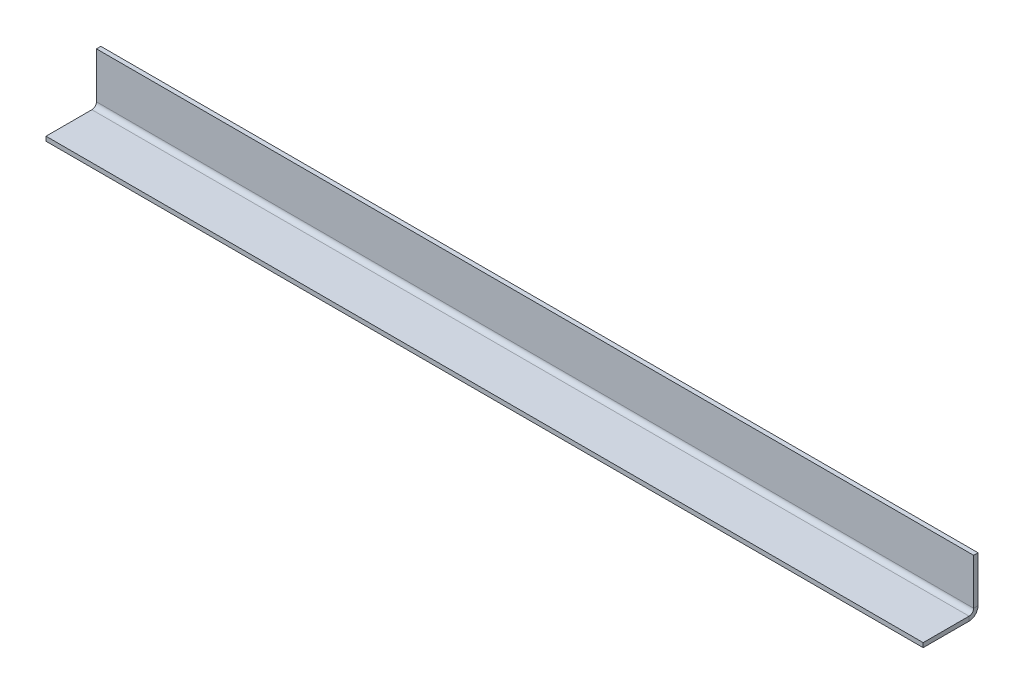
ISO-10303-21;
HEADER;
FILE_DESCRIPTION(('STEP AP214'),'2;1');
FILE_NAME('part.step','',(''),(''),'','','');
FILE_SCHEMA(('AUTOMOTIVE_DESIGN { 1 0 10303 214 1 1 1 1 }'));
ENDSEC;
DATA;
#1=APPLICATION_CONTEXT('core data for automotive mechanical design processes');
#2=APPLICATION_PROTOCOL_DEFINITION('international standard','automotive_design',2000,#1);
#3=PRODUCT_CONTEXT('',#1,'mechanical');
#4=PRODUCT('Part','Part','',(#3));
#5=PRODUCT_RELATED_PRODUCT_CATEGORY('part','',(#4));
#6=PRODUCT_DEFINITION_FORMATION('','',#4);
#7=PRODUCT_DEFINITION_CONTEXT('part definition',#1,'design');
#8=PRODUCT_DEFINITION('design','',#6,#7);
#9=PRODUCT_DEFINITION_SHAPE('','',#8);
#10=(LENGTH_UNIT() NAMED_UNIT(*) SI_UNIT(.MILLI.,.METRE.));
#11=(NAMED_UNIT(*) PLANE_ANGLE_UNIT() SI_UNIT($,.RADIAN.));
#12=(NAMED_UNIT(*) SI_UNIT($,.STERADIAN.) SOLID_ANGLE_UNIT());
#13=UNCERTAINTY_MEASURE_WITH_UNIT(LENGTH_MEASURE(1.E-05),#10,'distance_accuracy_value','');
#14=(GEOMETRIC_REPRESENTATION_CONTEXT(3) GLOBAL_UNCERTAINTY_ASSIGNED_CONTEXT((#13)) GLOBAL_UNIT_ASSIGNED_CONTEXT((#10,
#11,#12)) REPRESENTATION_CONTEXT('',''));
#15=CARTESIAN_POINT('',(0.,0.,0.));
#16=DIRECTION('',(0.,0.,1.));
#17=DIRECTION('',(1.,0.,0.));
#18=AXIS2_PLACEMENT_3D('',#15,#16,#17);
#19=CARTESIAN_POINT('',(0.,6.22299999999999,0.));
#20=DIRECTION('',(-1.,0.,0.));
#21=DIRECTION('',(0.,0.,1.));
#22=AXIS2_PLACEMENT_3D('',#19,#20,#21);
#23=PLANE('',#22);
#24=DIRECTION('',(0.,0.,1.));
#25=VECTOR('',#24,1.);
#26=CARTESIAN_POINT('',(0.,6.22299999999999,0.));
#27=LINE('',#26,#25);
#28=CARTESIAN_POINT('',(0.,6.22299999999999,0.));
#29=VERTEX_POINT('',#28);
#30=CARTESIAN_POINT('',(0.,6.22299999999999,3.048));
#31=VERTEX_POINT('',#30);
#32=EDGE_CURVE('E11',#29,#31,#27,.T.);
#33=ORIENTED_EDGE('',*,*,#32,.F.);
#34=CARTESIAN_POINT('',(0.,6.223,6.223));
#35=DIRECTION('',(1.,0.,0.));
#36=DIRECTION('',(0.,0.,-1.));
#37=AXIS2_PLACEMENT_3D('',#34,#35,#36);
#38=CIRCLE('',#37,6.223);
#39=CARTESIAN_POINT('',(0.,0.,6.223));
#40=VERTEX_POINT('',#39);
#41=EDGE_CURVE('E186',#29,#40,#38,.F.);
#42=ORIENTED_EDGE('',*,*,#41,.T.);
#43=DIRECTION('',(0.,-1.,0.));
#44=VECTOR('',#43,1.);
#45=CARTESIAN_POINT('',(0.,3.048,6.223));
#46=LINE('',#45,#44);
#47=CARTESIAN_POINT('',(0.,3.048,6.223));
#48=VERTEX_POINT('',#47);
#49=EDGE_CURVE('E56',#48,#40,#46,.T.);
#50=ORIENTED_EDGE('',*,*,#49,.F.);
#51=CARTESIAN_POINT('',(0.,6.223,6.223));
#52=DIRECTION('',(1.,0.,0.));
#53=DIRECTION('',(0.,0.,-1.));
#54=AXIS2_PLACEMENT_3D('',#51,#52,#53);
#55=CIRCLE('',#54,3.175);
#56=EDGE_CURVE('E201',#31,#48,#55,.F.);
#57=ORIENTED_EDGE('',*,*,#56,.F.);
#58=EDGE_LOOP('',(#33,#42,#50,#57));
#59=FACE_BOUND('',#58,.T.);
#60=ADVANCED_FACE('F48',(#59),#23,.T.);
#61=CARTESIAN_POINT('',(0.,3.048,6.223));
#62=DIRECTION('',(-1.,0.,0.));
#63=DIRECTION('',(0.,0.,1.));
#64=AXIS2_PLACEMENT_3D('',#61,#62,#63);
#65=PLANE('',#64);
#66=DIRECTION('',(0.,-1.,0.));
#67=VECTOR('',#66,1.);
#68=CARTESIAN_POINT('',(0.,0.,0.));
#69=LINE('',#68,#67);
#70=CARTESIAN_POINT('',(0.,38.1,0.));
#71=VERTEX_POINT('',#70);
#72=EDGE_CURVE('E189',#71,#29,#69,.T.);
#73=ORIENTED_EDGE('',*,*,#72,.T.);
#74=ORIENTED_EDGE('',*,*,#32,.T.);
#75=DIRECTION('',(0.,1.,0.));
#76=VECTOR('',#75,1.);
#77=CARTESIAN_POINT('',(0.,0.,3.048));
#78=LINE('',#77,#76);
#79=CARTESIAN_POINT('',(0.,38.1,3.048));
#80=VERTEX_POINT('',#79);
#81=EDGE_CURVE('E197',#80,#31,#78,.F.);
#82=ORIENTED_EDGE('',*,*,#81,.F.);
#83=DIRECTION('',(0.,0.,-1.));
#84=VECTOR('',#83,1.);
#85=CARTESIAN_POINT('',(0.,38.1,3.048));
#86=LINE('',#85,#84);
#87=EDGE_CURVE('E193',#80,#71,#86,.T.);
#88=ORIENTED_EDGE('',*,*,#87,.T.);
#89=EDGE_LOOP('',(#73,#74,#82,#88));
#90=FACE_BOUND('',#89,.T.);
#91=ADVANCED_FACE('F228',(#90),#65,.T.);
#92=CARTESIAN_POINT('',(663.481536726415,3.048,0.));
#93=DIRECTION('',(0.,-1.,0.));
#94=DIRECTION('',(0.,0.,-1.));
#95=AXIS2_PLACEMENT_3D('',#92,#93,#94);
#96=PLANE('',#95);
#97=DIRECTION('',(0.,0.,-1.));
#98=VECTOR('',#97,1.);
#99=CARTESIAN_POINT('',(609.6,3.048,0.));
#100=LINE('',#99,#98);
#101=CARTESIAN_POINT('',(609.6,3.048,6.223));
#102=VERTEX_POINT('',#101);
#103=CARTESIAN_POINT('',(609.6,3.04799999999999,38.1));
#104=VERTEX_POINT('',#103);
#105=EDGE_CURVE('E123',#102,#104,#100,.F.);
#106=ORIENTED_EDGE('',*,*,#105,.F.);
#107=DIRECTION('',(-1.,0.,0.));
#108=VECTOR('',#107,1.);
#109=CARTESIAN_POINT('',(663.481536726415,3.048,6.223));
#110=LINE('',#109,#108);
#111=EDGE_CURVE('E205',#102,#48,#110,.T.);
#112=ORIENTED_EDGE('',*,*,#111,.T.);
#113=DIRECTION('',(0.,0.,1.));
#114=VECTOR('',#113,1.);
#115=CARTESIAN_POINT('',(0.,3.048,0.));
#116=LINE('',#115,#114);
#117=CARTESIAN_POINT('',(0.,3.04799999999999,38.1));
#118=VERTEX_POINT('',#117);
#119=EDGE_CURVE('E168',#48,#118,#116,.T.);
#120=ORIENTED_EDGE('',*,*,#119,.T.);
#121=DIRECTION('',(-1.,0.,0.));
#122=VECTOR('',#121,1.);
#123=CARTESIAN_POINT('',(663.481536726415,3.04799999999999,38.1));
#124=LINE('',#123,#122);
#125=EDGE_CURVE('E154',#104,#118,#124,.T.);
#126=ORIENTED_EDGE('',*,*,#125,.F.);
#127=EDGE_LOOP('',(#106,#112,#120,#126));
#128=FACE_BOUND('',#127,.T.);
#129=ADVANCED_FACE('F270',(#128),#96,.F.);
#130=CARTESIAN_POINT('',(663.481536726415,0.,38.1));
#131=DIRECTION('',(0.,0.,1.));
#132=DIRECTION('',(1.,0.,0.));
#133=AXIS2_PLACEMENT_3D('',#130,#131,#132);
#134=PLANE('',#133);
#135=DIRECTION('',(-1.,0.,0.));
#136=VECTOR('',#135,1.);
#137=CARTESIAN_POINT('',(663.481536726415,0.,38.1));
#138=LINE('',#137,#136);
#139=CARTESIAN_POINT('',(609.6,0.,38.1));
#140=VERTEX_POINT('',#139);
#141=CARTESIAN_POINT('',(0.,0.,38.1));
#142=VERTEX_POINT('',#141);
#143=EDGE_CURVE('E149',#140,#142,#138,.T.);
#144=ORIENTED_EDGE('',*,*,#143,.F.);
#145=DIRECTION('',(0.,-1.,0.));
#146=VECTOR('',#145,1.);
#147=CARTESIAN_POINT('',(609.6,0.,38.1));
#148=LINE('',#147,#146);
#149=EDGE_CURVE('E122',#140,#104,#148,.F.);
#150=ORIENTED_EDGE('',*,*,#149,.T.);
#151=ORIENTED_EDGE('',*,*,#125,.T.);
#152=DIRECTION('',(0.,1.,0.));
#153=VECTOR('',#152,1.);
#154=CARTESIAN_POINT('',(0.,0.,38.1));
#155=LINE('',#154,#153);
#156=EDGE_CURVE('E170',#142,#118,#155,.T.);
#157=ORIENTED_EDGE('',*,*,#156,.F.);
#158=EDGE_LOOP('',(#144,#150,#151,#157));
#159=FACE_BOUND('',#158,.T.);
#160=ADVANCED_FACE('F274',(#159),#134,.T.);
#161=CARTESIAN_POINT('',(663.481536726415,0.,0.));
#162=DIRECTION('',(0.,-1.,0.));
#163=DIRECTION('',(0.,0.,-1.));
#164=AXIS2_PLACEMENT_3D('',#161,#162,#163);
#165=PLANE('',#164);
#166=DIRECTION('',(-1.,0.,0.));
#167=VECTOR('',#166,1.);
#168=CARTESIAN_POINT('',(663.481536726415,0.,6.223));
#169=LINE('',#168,#167);
#170=CARTESIAN_POINT('',(609.6,0.,6.223));
#171=VERTEX_POINT('',#170);
#172=EDGE_CURVE('E139',#171,#40,#169,.T.);
#173=ORIENTED_EDGE('',*,*,#172,.F.);
#174=DIRECTION('',(0.,0.,1.));
#175=VECTOR('',#174,1.);
#176=CARTESIAN_POINT('',(609.6,0.,0.));
#177=LINE('',#176,#175);
#178=EDGE_CURVE('E126',#171,#140,#177,.T.);
#179=ORIENTED_EDGE('',*,*,#178,.T.);
#180=ORIENTED_EDGE('',*,*,#143,.T.);
#181=DIRECTION('',(0.,0.,1.));
#182=VECTOR('',#181,1.);
#183=CARTESIAN_POINT('',(0.,0.,0.));
#184=LINE('',#183,#182);
#185=EDGE_CURVE('E147',#40,#142,#184,.T.);
#186=ORIENTED_EDGE('',*,*,#185,.F.);
#187=EDGE_LOOP('',(#173,#179,#180,#186));
#188=FACE_BOUND('',#187,.T.);
#189=ADVANCED_FACE('F145',(#188),#165,.T.);
#190=CARTESIAN_POINT('',(663.481536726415,6.223,6.223));
#191=DIRECTION('',(-1.,0.,0.));
#192=DIRECTION('',(0.,0.,1.));
#193=AXIS2_PLACEMENT_3D('',#190,#191,#192);
#194=CYLINDRICAL_SURFACE('',#193,6.223);
#195=DIRECTION('',(-1.,0.,0.));
#196=VECTOR('',#195,1.);
#197=CARTESIAN_POINT('',(663.481536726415,6.22299999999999,0.));
#198=LINE('',#197,#196);
#199=CARTESIAN_POINT('',(609.6,6.22299999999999,0.));
#200=VERTEX_POINT('',#199);
#201=EDGE_CURVE('E142',#200,#29,#198,.T.);
#202=ORIENTED_EDGE('',*,*,#201,.F.);
#203=CARTESIAN_POINT('',(609.6,6.223,6.223));
#204=DIRECTION('',(-1.,0.,0.));
#205=DIRECTION('',(0.,0.,1.));
#206=AXIS2_PLACEMENT_3D('',#203,#204,#205);
#207=CIRCLE('',#206,6.223);
#208=EDGE_CURVE('E116',#171,#200,#207,.F.);
#209=ORIENTED_EDGE('',*,*,#208,.F.);
#210=ORIENTED_EDGE('',*,*,#172,.T.);
#211=ORIENTED_EDGE('',*,*,#41,.F.);
#212=EDGE_LOOP('',(#202,#209,#210,#211));
#213=FACE_BOUND('',#212,.T.);
#214=ADVANCED_FACE('F137',(#213),#194,.T.);
#215=CARTESIAN_POINT('',(663.481536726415,0.,0.));
#216=DIRECTION('',(0.,0.,-1.));
#217=DIRECTION('',(-1.,0.,0.));
#218=AXIS2_PLACEMENT_3D('',#215,#216,#217);
#219=PLANE('',#218);
#220=DIRECTION('',(-1.,0.,0.));
#221=VECTOR('',#220,1.);
#222=CARTESIAN_POINT('',(663.481536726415,38.1,0.));
#223=LINE('',#222,#221);
#224=CARTESIAN_POINT('',(609.6,38.1,0.));
#225=VERTEX_POINT('',#224);
#226=EDGE_CURVE('E156',#225,#71,#223,.T.);
#227=ORIENTED_EDGE('',*,*,#226,.F.);
#228=DIRECTION('',(0.,1.,0.));
#229=VECTOR('',#228,1.);
#230=CARTESIAN_POINT('',(609.6,0.,0.));
#231=LINE('',#230,#229);
#232=EDGE_CURVE('E243',#225,#200,#231,.F.);
#233=ORIENTED_EDGE('',*,*,#232,.T.);
#234=ORIENTED_EDGE('',*,*,#201,.T.);
#235=ORIENTED_EDGE('',*,*,#72,.F.);
#236=EDGE_LOOP('',(#227,#233,#234,#235));
#237=FACE_BOUND('',#236,.T.);
#238=ADVANCED_FACE('F225',(#237),#219,.T.);
#239=CARTESIAN_POINT('',(663.481536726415,38.1,3.048));
#240=DIRECTION('',(0.,1.,0.));
#241=DIRECTION('',(0.,0.,1.));
#242=AXIS2_PLACEMENT_3D('',#239,#240,#241);
#243=PLANE('',#242);
#244=DIRECTION('',(-1.,0.,0.));
#245=VECTOR('',#244,1.);
#246=CARTESIAN_POINT('',(663.481536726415,38.1,3.048));
#247=LINE('',#246,#245);
#248=CARTESIAN_POINT('',(609.6,38.1,3.048));
#249=VERTEX_POINT('',#248);
#250=EDGE_CURVE('E212',#249,#80,#247,.T.);
#251=ORIENTED_EDGE('',*,*,#250,.F.);
#252=DIRECTION('',(0.,0.,1.));
#253=VECTOR('',#252,1.);
#254=CARTESIAN_POINT('',(609.6,38.1,3.048));
#255=LINE('',#254,#253);
#256=EDGE_CURVE('E180',#249,#225,#255,.F.);
#257=ORIENTED_EDGE('',*,*,#256,.T.);
#258=ORIENTED_EDGE('',*,*,#226,.T.);
#259=ORIENTED_EDGE('',*,*,#87,.F.);
#260=EDGE_LOOP('',(#251,#257,#258,#259));
#261=FACE_BOUND('',#260,.T.);
#262=ADVANCED_FACE('F222',(#261),#243,.T.);
#263=CARTESIAN_POINT('',(663.481536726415,0.,3.048));
#264=DIRECTION('',(0.,0.,-1.));
#265=DIRECTION('',(-1.,0.,0.));
#266=AXIS2_PLACEMENT_3D('',#263,#264,#265);
#267=PLANE('',#266);
#268=DIRECTION('',(0.,-1.,0.));
#269=VECTOR('',#268,1.);
#270=CARTESIAN_POINT('',(609.6,0.,3.048));
#271=LINE('',#270,#269);
#272=CARTESIAN_POINT('',(609.6,6.22299999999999,3.048));
#273=VERTEX_POINT('',#272);
#274=EDGE_CURVE('E63',#249,#273,#271,.T.);
#275=ORIENTED_EDGE('',*,*,#274,.F.);
#276=ORIENTED_EDGE('',*,*,#250,.T.);
#277=ORIENTED_EDGE('',*,*,#81,.T.);
#278=DIRECTION('',(-1.,0.,0.));
#279=VECTOR('',#278,1.);
#280=CARTESIAN_POINT('',(663.481536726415,6.22299999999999,3.048));
#281=LINE('',#280,#279);
#282=EDGE_CURVE('E208',#273,#31,#281,.T.);
#283=ORIENTED_EDGE('',*,*,#282,.F.);
#284=EDGE_LOOP('',(#275,#276,#277,#283));
#285=FACE_BOUND('',#284,.T.);
#286=ADVANCED_FACE('F231',(#285),#267,.F.);
#287=CARTESIAN_POINT('',(663.481536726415,6.223,6.223));
#288=DIRECTION('',(-1.,0.,0.));
#289=DIRECTION('',(0.,0.,1.));
#290=AXIS2_PLACEMENT_3D('',#287,#288,#289);
#291=CYLINDRICAL_SURFACE('',#290,3.175);
#292=CARTESIAN_POINT('',(609.6,6.223,6.223));
#293=DIRECTION('',(1.,0.,0.));
#294=DIRECTION('',(0.,0.,-1.));
#295=AXIS2_PLACEMENT_3D('',#292,#293,#294);
#296=CIRCLE('',#295,3.175);
#297=EDGE_CURVE('E118',#273,#102,#296,.F.);
#298=ORIENTED_EDGE('',*,*,#297,.F.);
#299=ORIENTED_EDGE('',*,*,#282,.T.);
#300=ORIENTED_EDGE('',*,*,#56,.T.);
#301=ORIENTED_EDGE('',*,*,#111,.F.);
#302=EDGE_LOOP('',(#298,#299,#300,#301));
#303=FACE_BOUND('',#302,.T.);
#304=ADVANCED_FACE('F234',(#303),#291,.F.);
#305=CARTESIAN_POINT('',(0.,6.223,6.223));
#306=DIRECTION('',(1.,0.,0.));
#307=DIRECTION('',(0.,0.,-1.));
#308=AXIS2_PLACEMENT_3D('',#305,#306,#307);
#309=PLANE('',#308);
#310=ORIENTED_EDGE('',*,*,#119,.F.);
#311=ORIENTED_EDGE('',*,*,#49,.T.);
#312=ORIENTED_EDGE('',*,*,#185,.T.);
#313=ORIENTED_EDGE('',*,*,#156,.T.);
#314=EDGE_LOOP('',(#310,#311,#312,#313));
#315=FACE_BOUND('',#314,.T.);
#316=ADVANCED_FACE('F165',(#315),#309,.F.);
#317=CARTESIAN_POINT('',(609.6,0.,3.048));
#318=DIRECTION('',(1.,0.,0.));
#319=DIRECTION('',(0.,-1.,0.));
#320=AXIS2_PLACEMENT_3D('',#317,#318,#319);
#321=PLANE('',#320);
#322=ORIENTED_EDGE('',*,*,#274,.T.);
#323=DIRECTION('',(0.,0.,1.));
#324=VECTOR('',#323,1.);
#325=CARTESIAN_POINT('',(609.6,6.22299999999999,3.048));
#326=LINE('',#325,#324);
#327=EDGE_CURVE('E174',#273,#200,#326,.F.);
#328=ORIENTED_EDGE('',*,*,#327,.T.);
#329=ORIENTED_EDGE('',*,*,#232,.F.);
#330=ORIENTED_EDGE('',*,*,#256,.F.);
#331=EDGE_LOOP('',(#322,#328,#329,#330));
#332=FACE_BOUND('',#331,.T.);
#333=ADVANCED_FACE('F257',(#332),#321,.T.);
#334=CARTESIAN_POINT('',(609.6,0.,0.));
#335=DIRECTION('',(1.,0.,0.));
#336=DIRECTION('',(0.,0.,1.));
#337=AXIS2_PLACEMENT_3D('',#334,#335,#336);
#338=PLANE('',#337);
#339=ORIENTED_EDGE('',*,*,#149,.F.);
#340=ORIENTED_EDGE('',*,*,#178,.F.);
#341=DIRECTION('',(0.,-1.,0.));
#342=VECTOR('',#341,1.);
#343=CARTESIAN_POINT('',(609.6,0.,6.223));
#344=LINE('',#343,#342);
#345=EDGE_CURVE('E112',#171,#102,#344,.F.);
#346=ORIENTED_EDGE('',*,*,#345,.T.);
#347=ORIENTED_EDGE('',*,*,#105,.T.);
#348=EDGE_LOOP('',(#339,#340,#346,#347));
#349=FACE_BOUND('',#348,.T.);
#350=ADVANCED_FACE('F127',(#349),#338,.T.);
#351=CARTESIAN_POINT('',(609.6,6.223,6.223));
#352=DIRECTION('',(-1.,0.,0.));
#353=DIRECTION('',(0.,0.,1.));
#354=AXIS2_PLACEMENT_3D('',#351,#352,#353);
#355=PLANE('',#354);
#356=ORIENTED_EDGE('',*,*,#208,.T.);
#357=ORIENTED_EDGE('',*,*,#327,.F.);
#358=ORIENTED_EDGE('',*,*,#297,.T.);
#359=ORIENTED_EDGE('',*,*,#345,.F.);
#360=EDGE_LOOP('',(#356,#357,#358,#359));
#361=FACE_BOUND('',#360,.T.);
#362=ADVANCED_FACE('F114',(#361),#355,.F.);
#363=CLOSED_SHELL('',(#60,#91,#129,#160,#189,#214,#238,#262,#286,#304,#316,#333,#350,#362));
#364=MANIFOLD_SOLID_BREP('B2',#363);
#365=ADVANCED_BREP_SHAPE_REPRESENTATION('',(#18,#364),#14);
#366=SHAPE_DEFINITION_REPRESENTATION(#9,#365);
ENDSEC;
END-ISO-10303-21;
